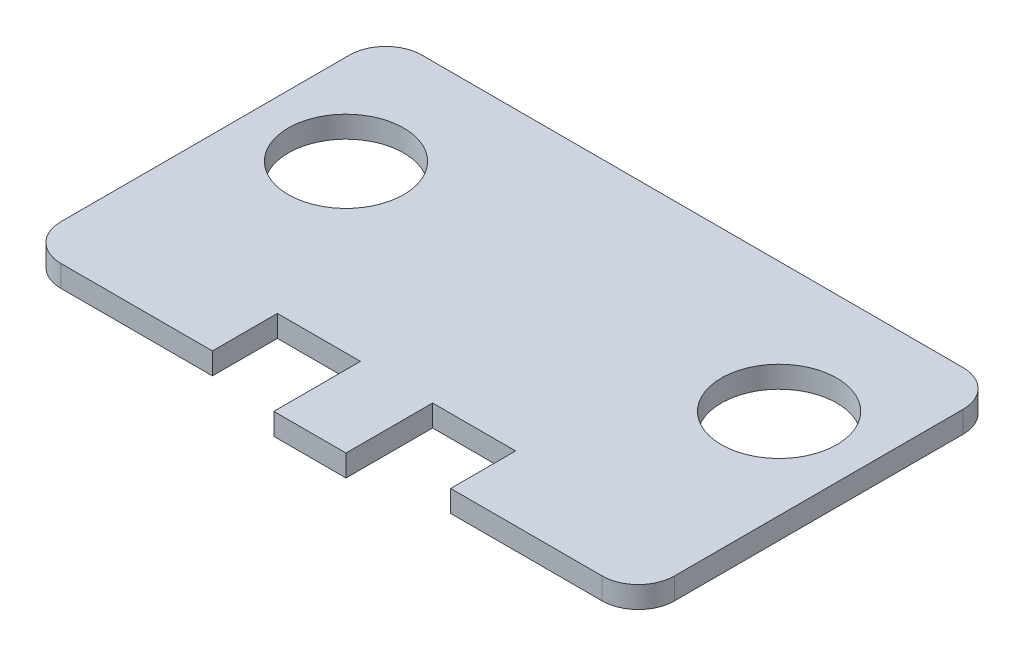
from build123d import *

# Parameters (mm, degrees)
SKETCH1_W           = 85
SKETCH1_H           = 50
BOSS_EXTRUDE1_DEPTH = 3
FILLET1_R           = 5
SKETCH2_R           = 8
CUT_EXTRUDE1_DEPTH  = 3
SKETCH4_W           = 16.5
SKETCH4_H           = 9
CUT_EXTRUDE2_DEPTH  = 3
SKETCH6_W           = 10
SKETCH6_H           = 12
BOSS_EXTRUDE2_DEPTH = 3


with BuildPart() as part:
    # Sketch1 → Boss-Extrude1 (new body)
    with BuildSketch(Plane(origin=(0, 0, 0), x_dir=(1, 0, 0), z_dir=(0, 1, 0))):
        Rectangle(SKETCH1_W, SKETCH1_H)
    extrude(amount=BOSS_EXTRUDE1_DEPTH)

    # Fillet1
    fillet1_edges = [part.edges().sort_by_distance(p)[0] for p in [
        (42.5, 1.5, 25),
        (-42.5, 1.5, 25),
        (-42.5, 1.5, -25),
        (42.5, 1.5, -25),
    ]]
    fillet(fillet1_edges, radius=FILLET1_R)

    # Sketch2 → Cut-Extrude1 (cut)
    with BuildSketch(Plane(origin=(0, 3, 0), x_dir=(1, 0, 0), z_dir=(0, 1, 0))):
        with Locations(Location((-30, 7, 0), (0, 0, 270))):
            Circle(SKETCH2_R)
        with Locations(Location((30, 7, 0), (0, 0, 270))):
            Circle(SKETCH2_R)
    extrude(amount=-CUT_EXTRUDE1_DEPTH, mode=Mode.SUBTRACT)

    # Sketch4 → Cut-Extrude2 (cut)
    with BuildSketch(Plane(origin=(0, 3, 0), x_dir=(1, 0, 0), z_dir=(0, 1, 0))):
        with Locations((-8.25, -20.5)):
            Rectangle(SKETCH4_W, SKETCH4_H)
    cut_extrude2 = extrude(amount=-CUT_EXTRUDE2_DEPTH, mode=Mode.SUBTRACT)

    # Mirror1: Cut-Extrude2 across plane
    add(cut_extrude2.mirror(Plane(origin=(0, 0, 0), x_dir=(0, 0, 1), z_dir=(1, 0, 0))), mode=Mode.SUBTRACT)

    # Sketch6 → Boss-Extrude2 (add)
    with BuildSketch(Plane(origin=(0, 3, 0), x_dir=(1, 0, 0), z_dir=(0, 1, 0))):
        with Locations((0, -22)):
            Rectangle(SKETCH6_W, SKETCH6_H)
    extrude(amount=-BOSS_EXTRUDE2_DEPTH)


solid = part.part
